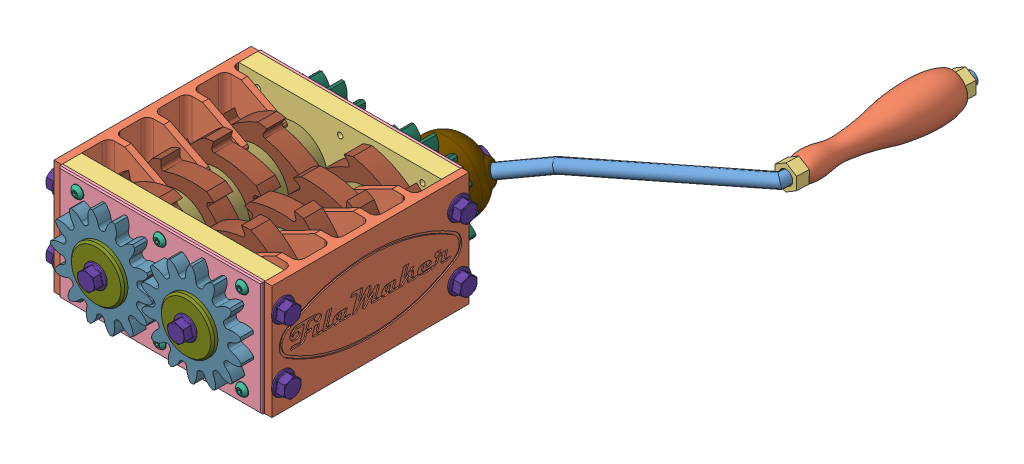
SolidWorks assembly 3dprinted shredder big.SLDASM, configuration Default (file format 5000). Lengths in mm.
Overall size (406.28 174.92 430.38).
77 component instances, 21 part files, 57 mates.
Components (placement in the parent):
- 20mm Bearing SKF 6204 RS286-7990-1: 20mm Bearing SKF 6204 RS286-7990.SLDPRT [Default] at (-44.5 45 1) x (0 0 1) z (-0.99979 -0.020484 0) size (14 47 47)
- side print-3: side print.SLDPRT [Default] at (6 45 79.9982) x (0 0 -1) z (0 1 0) size (155.6 50.59 90)
- side print-4: side print.SLDPRT [Default] at (-166 45 79.9982) x (0 0 1) z (0 1 0) size (155.6 50.59 90)
- bearing assembly-1: bearing assembly.SLDASM [Default] at (108.7588 -100.4942 153.0906) x (0.999798 -0.020112 0) z (0 0 1) size (161.78 93.2 20.75)
  - printed bearing holder-4: printed bearing holder.SLDPRT [Default] at (-110.7579 98.2865 -150.0906) x (0.999798 0.020112 0) z (0.020112 -0.999798 0) size (160 15 90)
  - printed bearing holder thin-2: printed bearing holder thin.SLDPRT [Default] at (-270.7256 95.0686 -137.0906) x (-0.999798 -0.020112 0) z (0.020112 -0.999798 0) size (160 3 90)
  - skf 6006 30x55x13-1: skf 6006 30x55x13.SLDPRT [Default] at (-227.1396 140.9545 -137.0906) x (0 0 -1) z (0.997594 -0.069334 0) size (13 55 55)
  - skf 6006 30x55x13-2: skf 6006 30x55x13.SLDPRT [Default] at (-156.154 142.3824 -150.0906) x (0 0 1) z (-0.908645 -0.417569 0) size (13 55 55)
  - socket button head screw_iso-1: socket button head screw_iso.sldprt [ISO 7380 - M5 x 12 --- 12S] at (-127.3639 177.9687 -155.8406) x (0 0 1) z (-1 0 0) size (14.75 9.5 9.5)
  - socket button head screw_iso-2: socket button head screw_iso.sldprt [ISO 7380 - M5 x 12 --- 12S] at (-125.956 107.9828 -155.8406) x (0 0 1) z (-1 0 0) size (14.75 9.5 9.5)
  - socket button head screw_iso-3: socket button head screw_iso.sldprt [ISO 7380 - M5 x 12 --- 12S] at (-192.3507 176.6614 -155.8406) x (0 0 1) z (-1 0 0) size (14.75 9.5 9.5)
  - socket button head screw_iso-4: socket button head screw_iso.sldprt [ISO 7380 - M5 x 12 --- 12S] at (-190.9429 106.6755 -155.8406) x (0 0 1) z (-1 0 0) size (14.75 9.5 9.5)
  - socket button head screw_iso-5: socket button head screw_iso.sldprt [ISO 7380 - M5 x 12 --- 12S] at (-257.3376 175.3541 -155.8406) x (0 0 1) z (-1 0 0) size (14.75 9.5 9.5)
  - socket button head screw_iso-6: socket button head screw_iso.sldprt [ISO 7380 - M5 x 12 --- 12S] at (-255.9297 105.3682 -155.8406) x (0 0 1) z (-1 0 0) size (14.75 9.5 9.5)
- bearing assembly-2: bearing assembly.SLDASM [Default] at (-268.7588 -100.4942 6.9094) x (-0.999798 -0.020112 0) z (0 0 -1) size (161.78 93.2 20.75)
  - printed bearing holder-4: printed bearing holder.SLDPRT [Default] at (-110.7579 98.2865 -150.0906) x (0.999798 0.020112 0) z (0.020112 -0.999798 0) size (160 15 90)
  - printed bearing holder thin-2: printed bearing holder thin.SLDPRT [Default] at (-270.7256 95.0686 -137.0906) x (-0.999798 -0.020112 0) z (0.020112 -0.999798 0) size (160 3 90)
  - skf 6006 30x55x13-1: skf 6006 30x55x13.SLDPRT [Default] at (-227.1396 140.9545 -137.0906) x (0 0 -1) z (0.997594 -0.069334 0) size (13 55 55)
  - skf 6006 30x55x13-2: skf 6006 30x55x13.SLDPRT [Default] at (-156.154 142.3824 -150.0906) x (0 0 1) z (-0.908645 -0.417569 0) size (13 55 55)
  - socket button head screw_iso-1: socket button head screw_iso.sldprt [ISO 7380 - M5 x 12 --- 12S] at (-127.3639 177.9687 -155.8406) x (0 0 1) z (-1 0 0) size (14.75 9.5 9.5)
  - socket button head screw_iso-2: socket button head screw_iso.sldprt [ISO 7380 - M5 x 12 --- 12S] at (-125.956 107.9828 -155.8406) x (0 0 1) z (-1 0 0) size (14.75 9.5 9.5)
  - socket button head screw_iso-3: socket button head screw_iso.sldprt [ISO 7380 - M5 x 12 --- 12S] at (-192.3507 176.6614 -155.8406) x (0 0 1) z (-1 0 0) size (14.75 9.5 9.5)
  - socket button head screw_iso-4: socket button head screw_iso.sldprt [ISO 7380 - M5 x 12 --- 12S] at (-190.9429 106.6755 -155.8406) x (0 0 1) z (-1 0 0) size (14.75 9.5 9.5)
  - socket button head screw_iso-5: socket button head screw_iso.sldprt [ISO 7380 - M5 x 12 --- 12S] at (-257.3376 175.3541 -155.8406) x (0 0 1) z (-1 0 0) size (14.75 9.5 9.5)
  - socket button head screw_iso-6: socket button head screw_iso.sldprt [ISO 7380 - M5 x 12 --- 12S] at (-255.9297 105.3682 -155.8406) x (0 0 1) z (-1 0 0) size (14.75 9.5 9.5)
- short shaft assembly-1: short shaft assembly.SLDASM [Default] at (-132.3298 57.9135 172) x (-0.991442 -0.130545 0) z (0 0 1) size (115.39 115.09 189)
  - for shaft1-2: for shaft1.SLDPRT [Default] at (-15 15 -56) x (1 0 0) z (0 -1 0) size (29.9 56 29.9)
  - square tube_iso-2: square tube_iso.sldprt [30 x 30 x 2.0x122] at (-30 0 -92) size (30 30 122)
  - for shaft1+5-3: for shaft1+5.SLDPRT [Default] at (-15 15 -128) x (-1 0 0) z (0 -1 0) size (29.9 61 29.9)
  - print st-6: print st.SLDPRT [Default] at (-15 15 -28) x (-0.313696 0.949523 0) z (-0.949523 -0.313696 0) size (40 3 40)
  - print st-7: print st.SLDPRT [Default] at (-15 15 -153) x (-0.580336 0.814377 0) z (-0.814377 -0.580336 0) size (40 3 40)
  - bioshredder 10-7: bioshredder 10.SLDPRT [15] at (-14.85 14.85 -44.95) x (0 -1 0) z (0 0 1) size (77.56 85.2 15)
  - bioshredder spacer 2-1: bioshredder spacer 2.SLDPRT [15,6] at (-15 15 -46) x (0.917794 0.397057 0) z (-0.397057 0.917794 0) size (52 15.6 52)
  - bioshredder 10-8: bioshredder 10.SLDPRT [15] at (-14.85 14.85 -75.55) x (0.707107 -0.707107 0) z (0 0 1) size (77.56 85.2 15)
  - bioshredder spacer 2-2: bioshredder spacer 2.SLDPRT [15,6] at (-15 15 -76.6) x (0.99848 -0.055107 0) z (0.055107 0.99848 0) size (52 15.6 52)
  - bioshredder 10-9: bioshredder 10.SLDPRT [15] at (-14.85 14.85 -106.15) size (77.56 85.2 15)
  - bioshredder 10-10: bioshredder 10.SLDPRT [15] at (-15.15 14.85 -136.75) x (0.707107 0.707107 0) z (0 0 1) size (77.56 85.2 15)
  - bioshredder spacer 2-5: bioshredder spacer 2.SLDPRT [15,6] at (-15.5 14.5 -107.2) x (1 0 0) z (0 1 0) size (52 15.6 52)
  - bioshredder spacer 2-6: bioshredder spacer 2.SLDPRT [15,6] at (-15.5 14.5 -137.8) x (1 0 0) z (0 1 0) size (52 15.6 52)
- longer shaft assembly-1: longer shaft assembly.SLDASM [Default] at (-45.5858 66.1854 -37) x (0.669987 0.742373 0) z (0 0 -1) size (115.09 115.11 209)
  - for shaft long-2: for shaft long.SLDPRT [Default] at (-15 15 -81) x (1 0 0) z (0 -1 0) size (29.9 81 29.9)
  - square tube_iso-2: square tube_iso.sldprt [30 x 30 x 2.0x122] at (-30 0 -117) size (30 30 122)
  - for shaft1-3: for shaft1.SLDPRT [Default] at (-15 15 -153) x (-1 0 0) z (0 -1 0) size (29.9 56 29.9)
  - print st-6: print st.SLDPRT [Default] at (-15 15 -53) x (-0.313696 0.949523 0) z (-0.949523 -0.313696 0) size (40 3 40)
  - print st-7: print st.SLDPRT [Default] at (-15 15 -178) x (-0.283519 0.958967 0) z (-0.958967 -0.283519 0) size (40 3 40)
  - bioshredder 10-7: bioshredder 10.SLDPRT [15] at (-15.15 14.85 -69.95) x (0 -1 0) z (0 0 1) size (77.56 85.2 15)
  - bioshredder 10-8: bioshredder 10.SLDPRT [15] at (-14.85 14.85 -100.55) x (0.707107 -0.707107 0) z (0 0 1) size (77.56 85.2 15)
  - bioshredder 10-9: bioshredder 10.SLDPRT [15] at (-14.85 14.85 -131.15) size (77.56 85.2 15)
  - bioshredder 10-10: bioshredder 10.SLDPRT [15] at (-14.85 14.8285 -161.75) x (0.707107 0.707107 0) z (0 0 1) size (77.56 85.2 15)
  - bioshredder spacer 2-1: bioshredder spacer 2.SLDPRT [15,6] at (-15 15 -178.4) x (1 0 0) z (0 -1 0) size (52 15.6 52)
  - bioshredder spacer 2-2: bioshredder spacer 2.SLDPRT [15,6] at (-15 15 -147.2) x (1 0 0) z (0 -1 0) size (52 15.6 52)
  - bioshredder spacer 2-3: bioshredder spacer 2.SLDPRT [15,6] at (-15 15 -116) x (1 0 0) z (0 -1 0) size (52 15.6 52)
  - bioshredder spacer 2-4: bioshredder spacer 2.SLDPRT [15,6] at (-15 15 -84.8) x (1 0 0) z (0 -1 0) size (52 15.6 52)
- spur gear-6: spur gear.SLDPRT [Default] at (-115.4925 44.9428 161) x (0 0 1) z (-0.608777 0.793342 0) size (14 78.45 80)
- spur gear-5: spur gear.SLDPRT [Default] at (-44.4571 44.9613 161) x (0 0 1) z (-0.977907 0.209039 0) size (14 78.45 80)
- spur gear 15mm-3: spur gear 15mm.SLDPRT [Default] at (-115.4925 44.9428 -1) x (0 0 -1) z (0.991442 0.130545 0) size (19 78.45 80)
- cup-1: cup.SLDPRT [Default] at (-115.5 45 175) x (1 0 0) z (0 1 0) size (42 4 42)
- cup-2: cup.SLDPRT [Default] at (-44.5 45 175) x (1 0 0) z (0 1 0) size (42 4 42)
- cup-3: cup.SLDPRT [Default] at (-115.5 45 -20) x (-0.923728 -0.383049 0) z (-0.383049 0.923728 0) size (42 4 42)
- hex flange bolt_din-1: hex flange bolt_din.sldprt [DIN 6921 - M8 x 30 x 30-S] at (-115.5 45 -28.1) x (0 0 1) z (-1 0 0) size (38.1 18 18)
- hex flange bolt_din-2: hex flange bolt_din.sldprt [DIN 6921 - M8 x 30 x 30-S] at (-44.5 45 183.1) x (0 0 -1) z (0.976773 0.214279 0) size (38.1 18 18)
- hex flange bolt_din-3: hex flange bolt_din.sldprt [DIN 6921 - M8 x 30 x 30-S] at (-115.5 45 183.1) x (0 0 -1) z (0.976773 0.214279 0) size (38.1 18 18)
- hex flange bolt_din-5: hex flange bolt_din.sldprt [DIN 6921 - M8 x 30 x 30-S] at (14.1 70 149.5) x (-1 0 0) z (0 -0.144442 -0.989513) size (38.1 18 18)
- hex flange bolt_din-6: hex flange bolt_din.sldprt [DIN 6921 - M8 x 30 x 30-S] at (14.1 20 149.5) x (-1 0 0) z (0 -0.144442 -0.989513) size (38.1 18 18)
- hex flange bolt_din-7: hex flange bolt_din.sldprt [DIN 6921 - M8 x 30 x 30-S] at (14.1 70 10.5) x (-1 0 0) z (0 -0.144442 -0.989513) size (38.1 18 18)
- hex flange bolt_din-8: hex flange bolt_din.sldprt [DIN 6921 - M8 x 30 x 30-S] at (14.1 20 10.5) x (-1 0 0) z (0 -0.144442 -0.989513) size (38.1 18 18)
- hex flange bolt_din-9: hex flange bolt_din.sldprt [DIN 6921 - M8 x 30 x 30-S] at (-174.1 70 10.5) x (1 0 0) z (0 0.859378 0.511341) size (38.1 18 18)
- hex flange bolt_din-10: hex flange bolt_din.sldprt [DIN 6921 - M8 x 30 x 30-S] at (-174.1 20 10.5) x (1 0 0) z (0 0.859378 0.511341) size (38.1 18 18)
- hex flange bolt_din-11: hex flange bolt_din.sldprt [DIN 6921 - M8 x 30 x 30-S] at (-174.1 70 149.5) x (1 0 0) z (0 0.859378 0.511341) size (38.1 18 18)
- hex flange bolt_din-12: hex flange bolt_din.sldprt [DIN 6921 - M8 x 30 x 30-S] at (-174.1 20 149.5) x (1 0 0) z (0 0.859378 0.511341) size (38.1 18 18)
- spur gear 15mm-4: spur gear 15mm.SLDPRT [Default] at (-44.5121 44.9435 -1) x (0 0 -1) z (0.307921 -0.951412 0) size (19 78.45 80)
- dom-1: dom.SLDPRT [Default] at (-44.4022 44.9791 -16) x (-0.307921 0.951412 0) z (-0.951412 -0.307921 0) size (55 37 55)
- handle-1: handle.SLDPRT [Default] at (-33.1759 48.6124 -40.3125) x (-0.465063 -0.185924 -0.865534) z (-0.823947 -0.266667 0.5) size (138.54 10 278.52)
- print handle-1: print handle.SLDPRT [Default] at (157.5008 107.9694 -232.349) x (0.009217 -0.027682 -0.999574) z (0.999574 -0.027417 0.009977) size (120.46 34.53 34.53)
- hex flange bolt_din-13: hex flange bolt_din.sldprt [DIN 6921 - M8 x 30 x 30-S] at (-44.4022 44.9791 -59.1) x (0 0 1) z (-1 0 0) size (38.1 18 18)
- nut 17-1: nut 17.SLDPRT [Default] at (156.3486 111.4296 -107.4022) x (0.999917 0.009217 0.008965) z (0.008965 -0.999574 0.027764) size (17 10 19.63)
- nut 17-2: nut 17.SLDPRT [Default] at (157.5511 107.8182 -237.8095) x (0.999917 0.009217 0.008965) z (0.008965 -0.999574 0.027764) size (17 10 19.63)
Mates (geometry in assembly coordinates):
- Coincident47: coincident aligned: plane of bearing assembly-1/printed bearing holder-4 through (0 0 16) normal (1 0 0); plane of bearing assembly-2/printed bearing holder-4 through (0 0 144) normal (1 0 0)
- Coincident48: coincident aligned: plane of bearing assembly-1/printed bearing holder-4 through (0 90 16) normal (0 1 0); plane of bearing assembly-2/printed bearing holder-4 through (-160 90 144) normal (0 1 0)
- Coincident49: coincident anti-aligned: plane of bearing assembly-1/skf 6006 30x55x13-1 through (-115.5 45 16) normal (0 0 1); plane of short shaft assembly-1/print st-7 through (-115.5 45 16) normal (0 0 -1)
- Coincident50: coincident anti-aligned: plane of bearing assembly-2/skf 6006 30x55x13-2 through (-115.5 45 144) normal (0 0 -1); plane of short shaft assembly-1/print st-6 through (-115.5 45 144) normal (0 0 1)
- Concentric20: concentric anti-aligned: cylinder of bearing assembly-2/skf 6006 30x55x13-2 through (-115.5 45 144) axis (0 0 1) radius 15; cylinder of short shaft assembly-1/for shaft1-2 through (-115.5 45 157) axis (0 0 -1) radius 14.95
- Coincident51: coincident anti-aligned: plane of bearing assembly-2/skf 6006 30x55x13-1 through (-44.5 45 144) normal (0 0 -1); plane of longer shaft assembly-1/print st-7 through (-44.5 45 144) normal (0 0 1)
- Concentric21: concentric aligned: cylinder of bearing assembly-2/skf 6006 30x55x13-1 through (-44.5 45 157) axis (0 0 -1) radius 15; cylinder of longer shaft assembly-1/for shaft1-3 through (-44.5 45 157) axis (0 0 -1) radius 14.95
- Coincident52: coincident anti-aligned: plane of side print-3 through (0 45 79.9982) normal (-1 0 0); plane of bearing assembly-1/printed bearing holder-4 through (0 0 16) normal (1 0 0)
- Coincident53: coincident aligned: plane of side print-3 through (0 90 157.7982) normal (0 1 0); plane of bearing assembly-2/printed bearing holder-4 through (-160 90 144) normal (0 1 0)
- Coincident54: coincident anti-aligned: plane of bearing assembly-1/printed bearing holder-4 through (0 0 16) normal (0 -1 0); plane of assembly through (0 0 0) normal (0 1 0)
- Coincident55: coincident aligned: plane of bearing assembly-1/printed bearing holder-4 through (0 0 16) normal (1 0 0); plane of assembly through (0 0 0) normal (1 0 0)
- Coincident56: coincident anti-aligned: plane of bearing assembly-1/printed bearing holder thin-2 through (-160 0 0) normal (0 0 -1); plane of assembly through (0 0 0) normal (0 0 1)
- Distance1: distance = 2.1982 mm aligned: plane of side print-3 through (0 0 2.1982) normal (0 0 -1); plane of bearing assembly-1/printed bearing holder thin-2 through (-160 0 0) normal (0 0 -1)
- Coincident58: coincident aligned: plane of side print-4 through (-160 90 2.1982) normal (0 1 0); plane of bearing assembly-1/printed bearing holder-4 through (0 90 16) normal (0 1 0)
- Coincident59: coincident aligned: plane of side print-3 through (0 0 2.1982) normal (0 0 -1); plane of side print-4 through (-160 0 2.1982) normal (0 0 -1)
- Coincident60: coincident anti-aligned: plane of side print-4 through (-160 45 79.9982) normal (1 0 0); plane of bearing assembly-1/printed bearing holder-4 through (-160 0 16) normal (-1 0 0)
- Coincident61: coincident anti-aligned: plane of short shaft assembly-1/for shaft1-2 through (-115.5 45 157) normal (0 0 1); plane of spur gear-6 through (-115.4925 44.9428 157) normal (0 0 -1)
- Coincident62: coincident aligned: plane of spur gear-6 through (-83.7588 69.2938 171) normal (0 0 1); plane of spur gear-5 through (-36.0956 84.0776 171) normal (0 0 1)
- Coincident63: coincident anti-aligned: plane of short shaft assembly-1/for shaft1-2 through (-104.5529 53.4003 172) normal (0.382666 0.923887 0); plane of spur gear-6 through (-104.4996 53.3782 157) normal (-0.382666 -0.923887 0)
- Coincident64: coincident anti-aligned: plane of short shaft assembly-1/for shaft1-2 through (-117.3014 58.6806 172) normal (-0.608777 0.793342 0); plane of spur gear-6 through (-117.3014 58.6806 157) normal (0.608777 -0.793342 0)
- Coincident65: coincident anti-aligned: plane of longer shaft assembly-1/for shaft1-3 through (-41.6155 58.4938 172) normal (-0.307921 0.951412 0); plane of spur gear-5 through (-41.5606 58.5116 157) normal (0.307921 -0.951412 0)
- Coincident66: coincident anti-aligned: plane of longer shaft assembly-1/for shaft1-3 through (-54.7438 54.2449 172) normal (-0.977907 0.209039 0); plane of spur gear-5 through (-54.7438 54.2449 157) normal (0.977907 -0.209039 0)
- Coincident67: coincident anti-aligned: plane of short shaft assembly-1/for shaft1+5-3 through (-117.3014 58.6806 -17) normal (0.382666 0.923887 0); plane of spur gear 15mm-3 through (-117.3014 58.6806 3) normal (-0.382666 -0.923887 0)
- Coincident68: coincident anti-aligned: plane of short shaft assembly-1/for shaft1+5-3 through (-128.2484 50.2803 -17) normal (-0.608777 0.793342 0); plane of spur gear 15mm-3 through (-128.2942 50.2451 3) normal (0.608777 -0.793342 0)
- Coincident69: coincident anti-aligned: plane of short shaft assembly-1/for shaft1+5-3 through (-115.5 45 3) normal (0 0 -1); plane of spur gear 15mm-3 through (-115.4925 44.9428 3) normal (0 0 1)
- Coincident70: coincident aligned: plane of cup-1 through (-115.5 45 172) normal (0 0 -1); plane of cup-2 through (-44.5 45 172) normal (0 0 -1)
- Coincident71: coincident anti-aligned: plane of spur gear-6 through (-83.7588 69.2938 171) normal (0 0 1); plane of cup-1 through (-115.5 45 171) normal (0 0 -1)
- Concentric22: concentric aligned: cylinder of short shaft assembly-1/for shaft1-2 through (-115.5 45 116) axis (0 0 1) radius 4.65; cylinder of cup-1 through (-115.5 45 172) axis (0 0 1) radius 5.25
- Concentric23: concentric aligned: cylinder of longer shaft assembly-1/for shaft1-3 through (-44.5 45 116) axis (0 0 1) radius 4.65; cylinder of cup-2 through (-44.5 45 172) axis (0 0 1) radius 5.25
- Coincident72: coincident anti-aligned: plane of spur gear 15mm-3 through (-120.7143 84.6005 -16) normal (0 0 -1); plane of cup-3 through (-115.5 45 -16) normal (0 0 1)
- Concentric24: concentric aligned: cylinder of short shaft assembly-1/for shaft1+5-3 through (-115.5 45 44) axis (0 0 -1) radius 4.65; cylinder of cup-3 through (-115.5 45 -17) axis (0 0 -1) radius 5.25
- Coincident73: coincident anti-aligned: plane of cup-3 through (-115.5 45 -20) normal (0 0 -1); plane of hex flange bolt_din-1 through (-115.5 52.5056 -20) normal (0 0 1)
- Concentric25: concentric aligned: cylinder of cup-3 through (-115.5 45 -17) axis (0 0 -1) radius 5.25; circle of hex flange bolt_din-1
- Coincident74: coincident aligned: plane of hex flange bolt_din-2 through (-46.1083 52.3312 175) normal (0 0 -1); plane of hex flange bolt_din-3 through (-117.1083 52.3312 175) normal (0 0 -1)
- Coincident75: coincident anti-aligned: plane of cup-1 through (-115.5 45 175) normal (0 0 1); plane of hex flange bolt_din-3 through (-117.1083 52.3312 175) normal (0 0 -1)
- Concentric26: concentric aligned: cylinder of cup-1 through (-115.5 45 172) axis (0 0 1) radius 5.25; circle of hex flange bolt_din-3
- Concentric27: concentric aligned: cylinder of cup-2 through (-44.5 45 172) axis (0 0 1) radius 5.25; circle of hex flange bolt_din-2
- Coincident76: coincident anti-aligned: plane of side print-3 through (6 45 79.9982) normal (1 0 0); plane of hex flange bolt_din-5 through (6 77.4268 148.4159) normal (-1 0 0)
- Concentric28: concentric aligned: cylinder of bearing assembly-2/printed bearing holder-4 through (-20 70 149.5) axis (1 0 0) radius 3.65; circle of hex flange bolt_din-5
- Coincident79: coincident anti-aligned: plane of side print-4 through (-166 45 79.9982) normal (-1 0 0); plane of hex flange bolt_din-9 through (-166 73.8379 4.0499) normal (1 0 0)
- Concentric31: concentric anti-aligned: circle of bearing assembly-1/printed bearing holder-4; circle of hex flange bolt_din-9
- Coincident80: coincident aligned: plane of spur gear 15mm-3 through (-120.7143 84.6005 -16) normal (0 0 -1); plane of spur gear 15mm-4 through (-6.4556 57.2604 -16) normal (0 0 -1)
- Coincident83: coincident anti-aligned: plane of longer shaft assembly-1/for shaft long-2 through (-41.6155 58.4938 -37) normal (0.669987 0.742373 0); plane of spur gear 15mm-4 through (-41.6155 58.4938 3) normal (-0.669987 -0.742373 0)
- Coincident84: coincident anti-aligned: plane of longer shaft assembly-1/for shaft long-2 through (-54.7438 54.2449 -37) normal (-0.307921 0.951412 0); plane of spur gear 15mm-4 through (-54.7987 54.2271 3) normal (0.307921 -0.951412 0)
- Coincident85: coincident anti-aligned: plane of spur gear 15mm-4 through (-6.4556 57.2604 -16) normal (0 0 -1); plane of dom-1 through (-44.4022 44.9791 -16) normal (0 0 1)
- Coincident86: coincident anti-aligned: plane of longer shaft assembly-1/for shaft long-2 through (-47.3845 31.5062 -37) normal (-0.669987 -0.742373 0); plane of dom-1 through (-47.2987 31.4288 -51) normal (0.669987 0.742373 0)
- Coincident87: coincident anti-aligned: plane of longer shaft assembly-1/for shaft long-2 through (-54.7438 54.2449 -37) normal (-0.307921 0.951412 0); plane of dom-1 through (-54.6888 54.2627 -51) normal (0.307921 -0.951412 0)
- Concentric33: concentric anti-aligned: cylinder of dom-1 through (-38.9246 46.7519 -36.824) axis (0.823947 0.266667 -0.5) radius 4.5; cylinder of handle-1 through (19.5786 65.6862 -72.3258) axis (-0.823947 -0.266667 0.5) radius 5
- Coincident88: coincident: point of longer shaft assembly-1/for shaft long-2; plane of handle-1 through (-33.1759 48.6124 -40.3125) normal (-0.823947 -0.266667 0.5)
- Concentric34: concentric aligned: cylinder of handle-1 through (156.2146 111.832 -92.8712) axis (0.009217 -0.027682 -0.999574) radius 5; cylinder of print handle-1 through (156.3486 111.4296 -107.4022) axis (0.009217 -0.027682 -0.999574) radius 5.25
- Distance2: distance = 15 mm aligned: plane of print handle-1 through (132.9451 128.7674 -228.6123) normal (0.009217 -0.027682 -0.999574); plane of handle-1 through (157.5972 107.6798 -242.8073) normal (0.009217 -0.027682 -0.999574)
- Coincident90: coincident anti-aligned: plane of dom-1 through (-44.4022 44.9791 -51) normal (0 0 -1); plane of hex flange bolt_din-13 through (-44.4022 52.4846 -51) normal (0 0 1)
- Concentric35: concentric aligned: cylinder of dom-1 through (-44.4022 44.9791 -16) axis (0 0 -1) radius 5.1; circle of hex flange bolt_din-13
- Concentric36: concentric aligned: cylinder of nut 17-1 through (156.2564 111.7064 -97.4064) axis (0.009217 -0.027682 -0.999574) radius 4.5; cylinder of nut 17-2 through (157.4589 108.095 -227.8137) axis (0.009217 -0.027682 -0.999574) radius 4.5
- Coincident91: coincident anti-aligned: plane of print handle-1 through (132.9451 128.7674 -228.6123) normal (0.009217 -0.027682 -0.999574); plane of nut 17-2 through (157.4589 108.095 -227.8137) normal (-0.009217 0.027682 0.999574)
- Coincident92: coincident anti-aligned: plane of print handle-1 through (156.3486 111.4296 -107.4022) normal (-0.009217 0.027682 0.999574); plane of nut 17-1 through (156.3486 111.4296 -107.4022) normal (0.009217 -0.027682 -0.999574)
- Concentric38: concentric aligned: cylinder of handle-1 through (156.2146 111.832 -92.8712) axis (0.009217 -0.027682 -0.999574) radius 5; cylinder of nut 17-2 through (157.4589 108.095 -227.8137) axis (0.009217 -0.027682 -0.999574) radius 4.5
